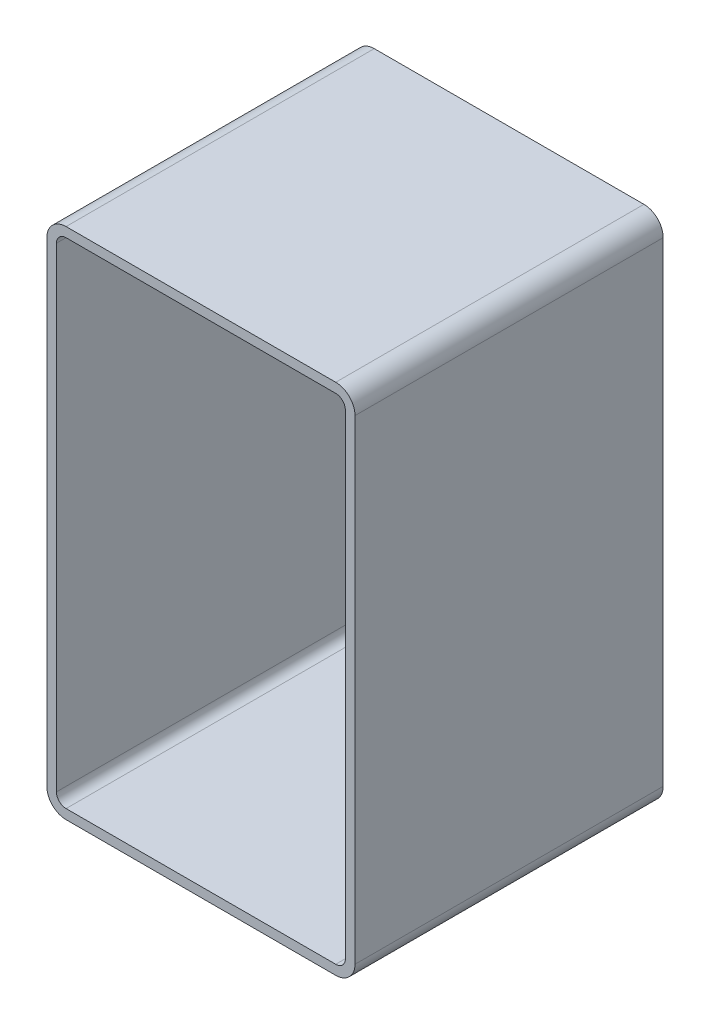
ISO-10303-21;
HEADER;
FILE_DESCRIPTION(('STEP AP214'),'2;1');
FILE_NAME('part.step','',(''),(''),'','','');
FILE_SCHEMA(('AUTOMOTIVE_DESIGN { 1 0 10303 214 1 1 1 1 }'));
ENDSEC;
DATA;
#1=APPLICATION_CONTEXT('core data for automotive mechanical design processes');
#2=APPLICATION_PROTOCOL_DEFINITION('international standard','automotive_design',2000,#1);
#3=PRODUCT_CONTEXT('',#1,'mechanical');
#4=PRODUCT('Part','Part','',(#3));
#5=PRODUCT_RELATED_PRODUCT_CATEGORY('part','',(#4));
#6=PRODUCT_DEFINITION_FORMATION('','',#4);
#7=PRODUCT_DEFINITION_CONTEXT('part definition',#1,'design');
#8=PRODUCT_DEFINITION('design','',#6,#7);
#9=PRODUCT_DEFINITION_SHAPE('','',#8);
#10=(LENGTH_UNIT() NAMED_UNIT(*) SI_UNIT(.MILLI.,.METRE.));
#11=(NAMED_UNIT(*) PLANE_ANGLE_UNIT() SI_UNIT($,.RADIAN.));
#12=(NAMED_UNIT(*) SI_UNIT($,.STERADIAN.) SOLID_ANGLE_UNIT());
#13=UNCERTAINTY_MEASURE_WITH_UNIT(LENGTH_MEASURE(1.E-05),#10,'distance_accuracy_value','');
#14=(GEOMETRIC_REPRESENTATION_CONTEXT(3) GLOBAL_UNCERTAINTY_ASSIGNED_CONTEXT((#13)) GLOBAL_UNIT_ASSIGNED_CONTEXT((#10,
#11,#12)) REPRESENTATION_CONTEXT('',''));
#15=CARTESIAN_POINT('',(0.,0.,0.));
#16=DIRECTION('',(0.,0.,1.));
#17=DIRECTION('',(1.,0.,0.));
#18=AXIS2_PLACEMENT_3D('',#15,#16,#17);
#19=CARTESIAN_POINT('',(20.1567030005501,490.641228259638,304.8));
#20=DIRECTION('',(0.,0.,1.));
#21=DIRECTION('',(1.,0.,0.));
#22=AXIS2_PLACEMENT_3D('',#19,#20,#21);
#23=PLANE('',#22);
#24=CARTESIAN_POINT('',(20.1567030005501,490.641228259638,304.8));
#25=DIRECTION('',(0.,0.,1.));
#26=DIRECTION('',(1.,0.,0.));
#27=AXIS2_PLACEMENT_3D('',#24,#25,#26);
#28=CIRCLE('',#27,19.05);
#29=CARTESIAN_POINT('',(20.1567030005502,509.691228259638,304.8));
#30=VERTEX_POINT('',#29);
#31=CARTESIAN_POINT('',(1.10670300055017,490.641228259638,304.8));
#32=VERTEX_POINT('',#31);
#33=EDGE_CURVE('E211',#30,#32,#28,.T.);
#34=ORIENTED_EDGE('',*,*,#33,.T.);
#35=DIRECTION('',(0.,-1.,0.));
#36=VECTOR('',#35,1.);
#37=CARTESIAN_POINT('',(1.10670300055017,20.741228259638,304.8));
#38=LINE('',#37,#36);
#39=CARTESIAN_POINT('',(1.10670300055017,20.741228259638,304.8));
#40=VERTEX_POINT('',#39);
#41=EDGE_CURVE('E214',#32,#40,#38,.T.);
#42=ORIENTED_EDGE('',*,*,#41,.T.);
#43=CARTESIAN_POINT('',(20.1567030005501,20.741228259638,304.8));
#44=DIRECTION('',(0.,0.,1.));
#45=DIRECTION('',(1.,0.,0.));
#46=AXIS2_PLACEMENT_3D('',#43,#44,#45);
#47=CIRCLE('',#46,19.05);
#48=CARTESIAN_POINT('',(20.1567030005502,1.69122825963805,304.8));
#49=VERTEX_POINT('',#48);
#50=EDGE_CURVE('E217',#40,#49,#47,.T.);
#51=ORIENTED_EDGE('',*,*,#50,.T.);
#52=DIRECTION('',(1.,0.,0.));
#53=VECTOR('',#52,1.);
#54=CARTESIAN_POINT('',(286.85670300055,1.69122825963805,304.8));
#55=LINE('',#54,#53);
#56=CARTESIAN_POINT('',(286.85670300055,1.69122825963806,304.8));
#57=VERTEX_POINT('',#56);
#58=EDGE_CURVE('E219',#49,#57,#55,.T.);
#59=ORIENTED_EDGE('',*,*,#58,.T.);
#60=CARTESIAN_POINT('',(286.85670300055,20.741228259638,304.8));
#61=DIRECTION('',(0.,0.,1.));
#62=DIRECTION('',(1.,0.,0.));
#63=AXIS2_PLACEMENT_3D('',#60,#61,#62);
#64=CIRCLE('',#63,19.05);
#65=CARTESIAN_POINT('',(305.90670300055,20.741228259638,304.8));
#66=VERTEX_POINT('',#65);
#67=EDGE_CURVE('E221',#57,#66,#64,.T.);
#68=ORIENTED_EDGE('',*,*,#67,.T.);
#69=DIRECTION('',(0.,1.,0.));
#70=VECTOR('',#69,1.);
#71=CARTESIAN_POINT('',(305.90670300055,490.641228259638,304.8));
#72=LINE('',#71,#70);
#73=CARTESIAN_POINT('',(305.90670300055,490.641228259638,304.8));
#74=VERTEX_POINT('',#73);
#75=EDGE_CURVE('E223',#66,#74,#72,.T.);
#76=ORIENTED_EDGE('',*,*,#75,.T.);
#77=CARTESIAN_POINT('',(286.85670300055,490.641228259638,304.8));
#78=DIRECTION('',(0.,0.,1.));
#79=DIRECTION('',(1.,0.,0.));
#80=AXIS2_PLACEMENT_3D('',#77,#78,#79);
#81=CIRCLE('',#80,19.05);
#82=CARTESIAN_POINT('',(286.85670300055,509.691228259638,304.8));
#83=VERTEX_POINT('',#82);
#84=EDGE_CURVE('E225',#74,#83,#81,.T.);
#85=ORIENTED_EDGE('',*,*,#84,.T.);
#86=DIRECTION('',(-1.,0.,0.));
#87=VECTOR('',#86,1.);
#88=CARTESIAN_POINT('',(20.1567030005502,509.691228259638,304.8));
#89=LINE('',#88,#87);
#90=EDGE_CURVE('E227',#83,#30,#89,.T.);
#91=ORIENTED_EDGE('',*,*,#90,.T.);
#92=EDGE_LOOP('',(#34,#42,#51,#59,#68,#76,#85,#91));
#93=FACE_BOUND('',#92,.T.);
#94=DIRECTION('',(0.,-1.,0.));
#95=VECTOR('',#94,1.);
#96=CARTESIAN_POINT('',(10.6317030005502,20.741228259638,304.8));
#97=LINE('',#96,#95);
#98=CARTESIAN_POINT('',(10.6317030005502,490.641228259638,304.8));
#99=VERTEX_POINT('',#98);
#100=CARTESIAN_POINT('',(10.6317030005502,20.741228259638,304.8));
#101=VERTEX_POINT('',#100);
#102=EDGE_CURVE('E154',#99,#101,#97,.T.);
#103=ORIENTED_EDGE('',*,*,#102,.F.);
#104=CARTESIAN_POINT('',(20.1567030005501,490.641228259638,304.8));
#105=DIRECTION('',(0.,0.,1.));
#106=DIRECTION('',(1.,0.,0.));
#107=AXIS2_PLACEMENT_3D('',#104,#105,#106);
#108=CIRCLE('',#107,9.52499999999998);
#109=CARTESIAN_POINT('',(20.1567030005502,500.166228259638,304.8));
#110=VERTEX_POINT('',#109);
#111=EDGE_CURVE('E146',#110,#99,#108,.T.);
#112=ORIENTED_EDGE('',*,*,#111,.F.);
#113=DIRECTION('',(-1.,0.,0.));
#114=VECTOR('',#113,1.);
#115=CARTESIAN_POINT('',(20.1567030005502,500.166228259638,304.8));
#116=LINE('',#115,#114);
#117=CARTESIAN_POINT('',(286.85670300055,500.166228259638,304.8));
#118=VERTEX_POINT('',#117);
#119=EDGE_CURVE('E179',#118,#110,#116,.T.);
#120=ORIENTED_EDGE('',*,*,#119,.F.);
#121=CARTESIAN_POINT('',(286.85670300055,490.641228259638,304.8));
#122=DIRECTION('',(0.,0.,1.));
#123=DIRECTION('',(1.,0.,0.));
#124=AXIS2_PLACEMENT_3D('',#121,#122,#123);
#125=CIRCLE('',#124,9.52499999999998);
#126=CARTESIAN_POINT('',(296.38170300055,490.641228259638,304.8));
#127=VERTEX_POINT('',#126);
#128=EDGE_CURVE('E177',#127,#118,#125,.T.);
#129=ORIENTED_EDGE('',*,*,#128,.F.);
#130=DIRECTION('',(0.,1.,0.));
#131=VECTOR('',#130,1.);
#132=CARTESIAN_POINT('',(296.38170300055,490.641228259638,304.8));
#133=LINE('',#132,#131);
#134=CARTESIAN_POINT('',(296.38170300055,20.741228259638,304.8));
#135=VERTEX_POINT('',#134);
#136=EDGE_CURVE('E175',#135,#127,#133,.T.);
#137=ORIENTED_EDGE('',*,*,#136,.F.);
#138=CARTESIAN_POINT('',(286.85670300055,20.741228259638,304.8));
#139=DIRECTION('',(0.,0.,1.));
#140=DIRECTION('',(1.,0.,0.));
#141=AXIS2_PLACEMENT_3D('',#138,#139,#140);
#142=CIRCLE('',#141,9.52499999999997);
#143=CARTESIAN_POINT('',(286.85670300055,11.2162282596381,304.8));
#144=VERTEX_POINT('',#143);
#145=EDGE_CURVE('E173',#144,#135,#142,.T.);
#146=ORIENTED_EDGE('',*,*,#145,.F.);
#147=DIRECTION('',(1.,0.,0.));
#148=VECTOR('',#147,1.);
#149=CARTESIAN_POINT('',(286.85670300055,11.216228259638,304.8));
#150=LINE('',#149,#148);
#151=CARTESIAN_POINT('',(20.1567030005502,11.216228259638,304.8));
#152=VERTEX_POINT('',#151);
#153=EDGE_CURVE('E169',#152,#144,#150,.T.);
#154=ORIENTED_EDGE('',*,*,#153,.F.);
#155=CARTESIAN_POINT('',(20.1567030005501,20.741228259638,304.8));
#156=DIRECTION('',(0.,0.,1.));
#157=DIRECTION('',(1.,0.,0.));
#158=AXIS2_PLACEMENT_3D('',#155,#156,#157);
#159=CIRCLE('',#158,9.52499999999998);
#160=EDGE_CURVE('E167',#101,#152,#159,.T.);
#161=ORIENTED_EDGE('',*,*,#160,.F.);
#162=EDGE_LOOP('',(#103,#112,#120,#129,#137,#146,#154,#161));
#163=FACE_BOUND('',#162,.T.);
#164=ADVANCED_FACE('F33',(#93,#163),#23,.T.);
#165=CARTESIAN_POINT('',(20.1567030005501,490.641228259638,0.));
#166=DIRECTION('',(0.,0.,1.));
#167=DIRECTION('',(1.,0.,0.));
#168=AXIS2_PLACEMENT_3D('',#165,#166,#167);
#169=PLANE('',#168);
#170=CARTESIAN_POINT('',(20.1567030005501,490.641228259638,0.));
#171=DIRECTION('',(0.,0.,1.));
#172=DIRECTION('',(1.,0.,0.));
#173=AXIS2_PLACEMENT_3D('',#170,#171,#172);
#174=CIRCLE('',#173,19.05);
#175=CARTESIAN_POINT('',(20.1567030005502,509.691228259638,0.));
#176=VERTEX_POINT('',#175);
#177=CARTESIAN_POINT('',(1.10670300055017,490.641228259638,0.));
#178=VERTEX_POINT('',#177);
#179=EDGE_CURVE('E162',#176,#178,#174,.T.);
#180=ORIENTED_EDGE('',*,*,#179,.F.);
#181=DIRECTION('',(-1.,0.,0.));
#182=VECTOR('',#181,1.);
#183=CARTESIAN_POINT('',(20.1567030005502,509.691228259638,0.));
#184=LINE('',#183,#182);
#185=CARTESIAN_POINT('',(286.85670300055,509.691228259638,0.));
#186=VERTEX_POINT('',#185);
#187=EDGE_CURVE('E215',#186,#176,#184,.T.);
#188=ORIENTED_EDGE('',*,*,#187,.F.);
#189=CARTESIAN_POINT('',(286.85670300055,490.641228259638,0.));
#190=DIRECTION('',(0.,0.,1.));
#191=DIRECTION('',(1.,0.,0.));
#192=AXIS2_PLACEMENT_3D('',#189,#190,#191);
#193=CIRCLE('',#192,19.05);
#194=CARTESIAN_POINT('',(305.90670300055,490.641228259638,0.));
#195=VERTEX_POINT('',#194);
#196=EDGE_CURVE('E242',#195,#186,#193,.T.);
#197=ORIENTED_EDGE('',*,*,#196,.F.);
#198=DIRECTION('',(0.,1.,0.));
#199=VECTOR('',#198,1.);
#200=CARTESIAN_POINT('',(305.90670300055,490.641228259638,0.));
#201=LINE('',#200,#199);
#202=CARTESIAN_POINT('',(305.90670300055,20.741228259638,0.));
#203=VERTEX_POINT('',#202);
#204=EDGE_CURVE('E240',#203,#195,#201,.T.);
#205=ORIENTED_EDGE('',*,*,#204,.F.);
#206=CARTESIAN_POINT('',(286.85670300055,20.741228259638,0.));
#207=DIRECTION('',(0.,0.,1.));
#208=DIRECTION('',(1.,0.,0.));
#209=AXIS2_PLACEMENT_3D('',#206,#207,#208);
#210=CIRCLE('',#209,19.05);
#211=CARTESIAN_POINT('',(286.85670300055,1.69122825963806,0.));
#212=VERTEX_POINT('',#211);
#213=EDGE_CURVE('E238',#212,#203,#210,.T.);
#214=ORIENTED_EDGE('',*,*,#213,.F.);
#215=DIRECTION('',(1.,0.,0.));
#216=VECTOR('',#215,1.);
#217=CARTESIAN_POINT('',(286.85670300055,1.69122825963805,0.));
#218=LINE('',#217,#216);
#219=CARTESIAN_POINT('',(20.1567030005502,1.69122825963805,0.));
#220=VERTEX_POINT('',#219);
#221=EDGE_CURVE('E236',#220,#212,#218,.T.);
#222=ORIENTED_EDGE('',*,*,#221,.F.);
#223=CARTESIAN_POINT('',(20.1567030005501,20.741228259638,0.));
#224=DIRECTION('',(0.,0.,1.));
#225=DIRECTION('',(1.,0.,0.));
#226=AXIS2_PLACEMENT_3D('',#223,#224,#225);
#227=CIRCLE('',#226,19.05);
#228=CARTESIAN_POINT('',(1.10670300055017,20.741228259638,0.));
#229=VERTEX_POINT('',#228);
#230=EDGE_CURVE('E234',#229,#220,#227,.T.);
#231=ORIENTED_EDGE('',*,*,#230,.F.);
#232=DIRECTION('',(0.,-1.,0.));
#233=VECTOR('',#232,1.);
#234=CARTESIAN_POINT('',(1.10670300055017,20.741228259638,0.));
#235=LINE('',#234,#233);
#236=EDGE_CURVE('E232',#178,#229,#235,.T.);
#237=ORIENTED_EDGE('',*,*,#236,.F.);
#238=EDGE_LOOP('',(#180,#188,#197,#205,#214,#222,#231,#237));
#239=FACE_BOUND('',#238,.T.);
#240=CARTESIAN_POINT('',(20.1567030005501,490.641228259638,0.));
#241=DIRECTION('',(0.,0.,1.));
#242=DIRECTION('',(1.,0.,0.));
#243=AXIS2_PLACEMENT_3D('',#240,#241,#242);
#244=CIRCLE('',#243,9.52499999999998);
#245=CARTESIAN_POINT('',(20.1567030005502,500.166228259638,0.));
#246=VERTEX_POINT('',#245);
#247=CARTESIAN_POINT('',(10.6317030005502,490.641228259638,0.));
#248=VERTEX_POINT('',#247);
#249=EDGE_CURVE('E56',#246,#248,#244,.T.);
#250=ORIENTED_EDGE('',*,*,#249,.T.);
#251=DIRECTION('',(0.,-1.,0.));
#252=VECTOR('',#251,1.);
#253=CARTESIAN_POINT('',(10.6317030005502,20.741228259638,0.));
#254=LINE('',#253,#252);
#255=CARTESIAN_POINT('',(10.6317030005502,20.741228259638,0.));
#256=VERTEX_POINT('',#255);
#257=EDGE_CURVE('E161',#248,#256,#254,.T.);
#258=ORIENTED_EDGE('',*,*,#257,.T.);
#259=CARTESIAN_POINT('',(20.1567030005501,20.741228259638,0.));
#260=DIRECTION('',(0.,0.,1.));
#261=DIRECTION('',(1.,0.,0.));
#262=AXIS2_PLACEMENT_3D('',#259,#260,#261);
#263=CIRCLE('',#262,9.52499999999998);
#264=CARTESIAN_POINT('',(20.1567030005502,11.216228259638,0.));
#265=VERTEX_POINT('',#264);
#266=EDGE_CURVE('E183',#256,#265,#263,.T.);
#267=ORIENTED_EDGE('',*,*,#266,.T.);
#268=DIRECTION('',(1.,0.,0.));
#269=VECTOR('',#268,1.);
#270=CARTESIAN_POINT('',(286.85670300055,11.216228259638,0.));
#271=LINE('',#270,#269);
#272=CARTESIAN_POINT('',(286.85670300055,11.2162282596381,0.));
#273=VERTEX_POINT('',#272);
#274=EDGE_CURVE('E186',#265,#273,#271,.T.);
#275=ORIENTED_EDGE('',*,*,#274,.T.);
#276=CARTESIAN_POINT('',(286.85670300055,20.741228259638,0.));
#277=DIRECTION('',(0.,0.,1.));
#278=DIRECTION('',(1.,0.,0.));
#279=AXIS2_PLACEMENT_3D('',#276,#277,#278);
#280=CIRCLE('',#279,9.52499999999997);
#281=CARTESIAN_POINT('',(296.38170300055,20.741228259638,0.));
#282=VERTEX_POINT('',#281);
#283=EDGE_CURVE('E189',#273,#282,#280,.T.);
#284=ORIENTED_EDGE('',*,*,#283,.T.);
#285=DIRECTION('',(0.,1.,0.));
#286=VECTOR('',#285,1.);
#287=CARTESIAN_POINT('',(296.38170300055,490.641228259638,0.));
#288=LINE('',#287,#286);
#289=CARTESIAN_POINT('',(296.38170300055,490.641228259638,0.));
#290=VERTEX_POINT('',#289);
#291=EDGE_CURVE('E192',#282,#290,#288,.T.);
#292=ORIENTED_EDGE('',*,*,#291,.T.);
#293=CARTESIAN_POINT('',(286.85670300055,490.641228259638,0.));
#294=DIRECTION('',(0.,0.,1.));
#295=DIRECTION('',(1.,0.,0.));
#296=AXIS2_PLACEMENT_3D('',#293,#294,#295);
#297=CIRCLE('',#296,9.52499999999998);
#298=CARTESIAN_POINT('',(286.85670300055,500.166228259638,0.));
#299=VERTEX_POINT('',#298);
#300=EDGE_CURVE('E195',#290,#299,#297,.T.);
#301=ORIENTED_EDGE('',*,*,#300,.T.);
#302=DIRECTION('',(-1.,0.,0.));
#303=VECTOR('',#302,1.);
#304=CARTESIAN_POINT('',(20.1567030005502,500.166228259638,0.));
#305=LINE('',#304,#303);
#306=EDGE_CURVE('E155',#299,#246,#305,.T.);
#307=ORIENTED_EDGE('',*,*,#306,.T.);
#308=EDGE_LOOP('',(#250,#258,#267,#275,#284,#292,#301,#307));
#309=FACE_BOUND('',#308,.T.);
#310=ADVANCED_FACE('F272',(#239,#309),#169,.F.);
#311=CARTESIAN_POINT('',(20.1567030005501,490.641228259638,304.8));
#312=DIRECTION('',(0.,0.,-1.));
#313=DIRECTION('',(-1.,0.,0.));
#314=AXIS2_PLACEMENT_3D('',#311,#312,#313);
#315=CYLINDRICAL_SURFACE('',#314,19.05);
#316=ORIENTED_EDGE('',*,*,#179,.T.);
#317=DIRECTION('',(0.,0.,-1.));
#318=VECTOR('',#317,1.);
#319=CARTESIAN_POINT('',(1.10670300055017,490.641228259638,304.8));
#320=LINE('',#319,#318);
#321=EDGE_CURVE('E11',#32,#178,#320,.T.);
#322=ORIENTED_EDGE('',*,*,#321,.F.);
#323=ORIENTED_EDGE('',*,*,#33,.F.);
#324=DIRECTION('',(0.,0.,-1.));
#325=VECTOR('',#324,1.);
#326=CARTESIAN_POINT('',(20.1567030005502,509.691228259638,304.8));
#327=LINE('',#326,#325);
#328=EDGE_CURVE('E229',#30,#176,#327,.T.);
#329=ORIENTED_EDGE('',*,*,#328,.T.);
#330=EDGE_LOOP('',(#316,#322,#323,#329));
#331=FACE_BOUND('',#330,.T.);
#332=ADVANCED_FACE('F35',(#331),#315,.T.);
#333=CARTESIAN_POINT('',(1.10670300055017,20.741228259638,304.8));
#334=DIRECTION('',(1.,0.,0.));
#335=DIRECTION('',(0.,0.,-1.));
#336=AXIS2_PLACEMENT_3D('',#333,#334,#335);
#337=PLANE('',#336);
#338=ORIENTED_EDGE('',*,*,#236,.T.);
#339=DIRECTION('',(0.,0.,-1.));
#340=VECTOR('',#339,1.);
#341=CARTESIAN_POINT('',(1.10670300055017,20.741228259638,304.8));
#342=LINE('',#341,#340);
#343=EDGE_CURVE('E41',#40,#229,#342,.T.);
#344=ORIENTED_EDGE('',*,*,#343,.F.);
#345=ORIENTED_EDGE('',*,*,#41,.F.);
#346=ORIENTED_EDGE('',*,*,#321,.T.);
#347=EDGE_LOOP('',(#338,#344,#345,#346));
#348=FACE_BOUND('',#347,.T.);
#349=ADVANCED_FACE('F289',(#348),#337,.F.);
#350=CARTESIAN_POINT('',(20.1567030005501,20.741228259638,304.8));
#351=DIRECTION('',(0.,0.,-1.));
#352=DIRECTION('',(-1.,0.,0.));
#353=AXIS2_PLACEMENT_3D('',#350,#351,#352);
#354=CYLINDRICAL_SURFACE('',#353,19.05);
#355=ORIENTED_EDGE('',*,*,#230,.T.);
#356=DIRECTION('',(0.,0.,-1.));
#357=VECTOR('',#356,1.);
#358=CARTESIAN_POINT('',(20.1567030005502,1.69122825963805,304.8));
#359=LINE('',#358,#357);
#360=EDGE_CURVE('E259',#49,#220,#359,.T.);
#361=ORIENTED_EDGE('',*,*,#360,.F.);
#362=ORIENTED_EDGE('',*,*,#50,.F.);
#363=ORIENTED_EDGE('',*,*,#343,.T.);
#364=EDGE_LOOP('',(#355,#361,#362,#363));
#365=FACE_BOUND('',#364,.T.);
#366=ADVANCED_FACE('F266',(#365),#354,.T.);
#367=CARTESIAN_POINT('',(286.85670300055,1.69122825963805,304.8));
#368=DIRECTION('',(0.,1.,0.));
#369=DIRECTION('',(0.,0.,1.));
#370=AXIS2_PLACEMENT_3D('',#367,#368,#369);
#371=PLANE('',#370);
#372=ORIENTED_EDGE('',*,*,#221,.T.);
#373=DIRECTION('',(0.,0.,-1.));
#374=VECTOR('',#373,1.);
#375=CARTESIAN_POINT('',(286.85670300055,1.69122825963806,304.8));
#376=LINE('',#375,#374);
#377=EDGE_CURVE('E256',#57,#212,#376,.T.);
#378=ORIENTED_EDGE('',*,*,#377,.F.);
#379=ORIENTED_EDGE('',*,*,#58,.F.);
#380=ORIENTED_EDGE('',*,*,#360,.T.);
#381=EDGE_LOOP('',(#372,#378,#379,#380));
#382=FACE_BOUND('',#381,.T.);
#383=ADVANCED_FACE('F278',(#382),#371,.F.);
#384=CARTESIAN_POINT('',(286.85670300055,20.741228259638,304.8));
#385=DIRECTION('',(0.,0.,-1.));
#386=DIRECTION('',(-1.,0.,0.));
#387=AXIS2_PLACEMENT_3D('',#384,#385,#386);
#388=CYLINDRICAL_SURFACE('',#387,19.05);
#389=ORIENTED_EDGE('',*,*,#213,.T.);
#390=DIRECTION('',(0.,0.,-1.));
#391=VECTOR('',#390,1.);
#392=CARTESIAN_POINT('',(305.90670300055,20.741228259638,304.8));
#393=LINE('',#392,#391);
#394=EDGE_CURVE('E253',#66,#203,#393,.T.);
#395=ORIENTED_EDGE('',*,*,#394,.F.);
#396=ORIENTED_EDGE('',*,*,#67,.F.);
#397=ORIENTED_EDGE('',*,*,#377,.T.);
#398=EDGE_LOOP('',(#389,#395,#396,#397));
#399=FACE_BOUND('',#398,.T.);
#400=ADVANCED_FACE('F282',(#399),#388,.T.);
#401=CARTESIAN_POINT('',(305.90670300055,490.641228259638,304.8));
#402=DIRECTION('',(-1.,0.,0.));
#403=DIRECTION('',(0.,0.,1.));
#404=AXIS2_PLACEMENT_3D('',#401,#402,#403);
#405=PLANE('',#404);
#406=ORIENTED_EDGE('',*,*,#204,.T.);
#407=DIRECTION('',(0.,0.,-1.));
#408=VECTOR('',#407,1.);
#409=CARTESIAN_POINT('',(305.90670300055,490.641228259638,304.8));
#410=LINE('',#409,#408);
#411=EDGE_CURVE('E250',#74,#195,#410,.T.);
#412=ORIENTED_EDGE('',*,*,#411,.F.);
#413=ORIENTED_EDGE('',*,*,#75,.F.);
#414=ORIENTED_EDGE('',*,*,#394,.T.);
#415=EDGE_LOOP('',(#406,#412,#413,#414));
#416=FACE_BOUND('',#415,.T.);
#417=ADVANCED_FACE('F302',(#416),#405,.F.);
#418=CARTESIAN_POINT('',(286.85670300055,490.641228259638,304.8));
#419=DIRECTION('',(0.,0.,-1.));
#420=DIRECTION('',(-1.,0.,0.));
#421=AXIS2_PLACEMENT_3D('',#418,#419,#420);
#422=CYLINDRICAL_SURFACE('',#421,19.05);
#423=ORIENTED_EDGE('',*,*,#196,.T.);
#424=DIRECTION('',(0.,0.,-1.));
#425=VECTOR('',#424,1.);
#426=CARTESIAN_POINT('',(286.85670300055,509.691228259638,304.8));
#427=LINE('',#426,#425);
#428=EDGE_CURVE('E247',#83,#186,#427,.T.);
#429=ORIENTED_EDGE('',*,*,#428,.F.);
#430=ORIENTED_EDGE('',*,*,#84,.F.);
#431=ORIENTED_EDGE('',*,*,#411,.T.);
#432=EDGE_LOOP('',(#423,#429,#430,#431));
#433=FACE_BOUND('',#432,.T.);
#434=ADVANCED_FACE('F300',(#433),#422,.T.);
#435=CARTESIAN_POINT('',(20.1567030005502,509.691228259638,304.8));
#436=DIRECTION('',(0.,-1.,0.));
#437=DIRECTION('',(0.,0.,-1.));
#438=AXIS2_PLACEMENT_3D('',#435,#436,#437);
#439=PLANE('',#438);
#440=ORIENTED_EDGE('',*,*,#187,.T.);
#441=ORIENTED_EDGE('',*,*,#328,.F.);
#442=ORIENTED_EDGE('',*,*,#90,.F.);
#443=ORIENTED_EDGE('',*,*,#428,.T.);
#444=EDGE_LOOP('',(#440,#441,#442,#443));
#445=FACE_BOUND('',#444,.T.);
#446=ADVANCED_FACE('F295',(#445),#439,.F.);
#447=CARTESIAN_POINT('',(20.1567030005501,490.641228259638,304.8));
#448=DIRECTION('',(0.,0.,-1.));
#449=DIRECTION('',(-1.,0.,0.));
#450=AXIS2_PLACEMENT_3D('',#447,#448,#449);
#451=CYLINDRICAL_SURFACE('',#450,9.52499999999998);
#452=ORIENTED_EDGE('',*,*,#249,.F.);
#453=DIRECTION('',(0.,0.,-1.));
#454=VECTOR('',#453,1.);
#455=CARTESIAN_POINT('',(20.1567030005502,500.166228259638,304.8));
#456=LINE('',#455,#454);
#457=EDGE_CURVE('E150',#110,#246,#456,.T.);
#458=ORIENTED_EDGE('',*,*,#457,.F.);
#459=ORIENTED_EDGE('',*,*,#111,.T.);
#460=DIRECTION('',(0.,0.,-1.));
#461=VECTOR('',#460,1.);
#462=CARTESIAN_POINT('',(10.6317030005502,490.641228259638,304.8));
#463=LINE('',#462,#461);
#464=EDGE_CURVE('E149',#99,#248,#463,.T.);
#465=ORIENTED_EDGE('',*,*,#464,.T.);
#466=EDGE_LOOP('',(#452,#458,#459,#465));
#467=FACE_BOUND('',#466,.T.);
#468=ADVANCED_FACE('F148',(#467),#451,.F.);
#469=CARTESIAN_POINT('',(10.6317030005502,20.741228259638,304.8));
#470=DIRECTION('',(1.,0.,0.));
#471=DIRECTION('',(0.,0.,-1.));
#472=AXIS2_PLACEMENT_3D('',#469,#470,#471);
#473=PLANE('',#472);
#474=ORIENTED_EDGE('',*,*,#257,.F.);
#475=ORIENTED_EDGE('',*,*,#464,.F.);
#476=ORIENTED_EDGE('',*,*,#102,.T.);
#477=DIRECTION('',(0.,0.,-1.));
#478=VECTOR('',#477,1.);
#479=CARTESIAN_POINT('',(10.6317030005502,20.741228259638,304.8));
#480=LINE('',#479,#478);
#481=EDGE_CURVE('E163',#101,#256,#480,.T.);
#482=ORIENTED_EDGE('',*,*,#481,.T.);
#483=EDGE_LOOP('',(#474,#475,#476,#482));
#484=FACE_BOUND('',#483,.T.);
#485=ADVANCED_FACE('F158',(#484),#473,.T.);
#486=CARTESIAN_POINT('',(20.1567030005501,20.741228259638,304.8));
#487=DIRECTION('',(0.,0.,-1.));
#488=DIRECTION('',(-1.,0.,0.));
#489=AXIS2_PLACEMENT_3D('',#486,#487,#488);
#490=CYLINDRICAL_SURFACE('',#489,9.52499999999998);
#491=ORIENTED_EDGE('',*,*,#266,.F.);
#492=ORIENTED_EDGE('',*,*,#481,.F.);
#493=ORIENTED_EDGE('',*,*,#160,.T.);
#494=DIRECTION('',(0.,0.,-1.));
#495=VECTOR('',#494,1.);
#496=CARTESIAN_POINT('',(20.1567030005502,11.216228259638,304.8));
#497=LINE('',#496,#495);
#498=EDGE_CURVE('E208',#152,#265,#497,.T.);
#499=ORIENTED_EDGE('',*,*,#498,.T.);
#500=EDGE_LOOP('',(#491,#492,#493,#499));
#501=FACE_BOUND('',#500,.T.);
#502=ADVANCED_FACE('F327',(#501),#490,.F.);
#503=CARTESIAN_POINT('',(286.85670300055,11.216228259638,304.8));
#504=DIRECTION('',(0.,1.,0.));
#505=DIRECTION('',(0.,0.,1.));
#506=AXIS2_PLACEMENT_3D('',#503,#504,#505);
#507=PLANE('',#506);
#508=ORIENTED_EDGE('',*,*,#274,.F.);
#509=ORIENTED_EDGE('',*,*,#498,.F.);
#510=ORIENTED_EDGE('',*,*,#153,.T.);
#511=DIRECTION('',(0.,0.,-1.));
#512=VECTOR('',#511,1.);
#513=CARTESIAN_POINT('',(286.85670300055,11.2162282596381,304.8));
#514=LINE('',#513,#512);
#515=EDGE_CURVE('E206',#144,#273,#514,.T.);
#516=ORIENTED_EDGE('',*,*,#515,.T.);
#517=EDGE_LOOP('',(#508,#509,#510,#516));
#518=FACE_BOUND('',#517,.T.);
#519=ADVANCED_FACE('F331',(#518),#507,.T.);
#520=CARTESIAN_POINT('',(286.85670300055,20.741228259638,304.8));
#521=DIRECTION('',(0.,0.,-1.));
#522=DIRECTION('',(-1.,0.,0.));
#523=AXIS2_PLACEMENT_3D('',#520,#521,#522);
#524=CYLINDRICAL_SURFACE('',#523,9.52499999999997);
#525=ORIENTED_EDGE('',*,*,#283,.F.);
#526=ORIENTED_EDGE('',*,*,#515,.F.);
#527=ORIENTED_EDGE('',*,*,#145,.T.);
#528=DIRECTION('',(0.,0.,-1.));
#529=VECTOR('',#528,1.);
#530=CARTESIAN_POINT('',(296.38170300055,20.741228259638,304.8));
#531=LINE('',#530,#529);
#532=EDGE_CURVE('E204',#135,#282,#531,.T.);
#533=ORIENTED_EDGE('',*,*,#532,.T.);
#534=EDGE_LOOP('',(#525,#526,#527,#533));
#535=FACE_BOUND('',#534,.T.);
#536=ADVANCED_FACE('F337',(#535),#524,.F.);
#537=CARTESIAN_POINT('',(296.38170300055,490.641228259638,304.8));
#538=DIRECTION('',(-1.,0.,0.));
#539=DIRECTION('',(0.,0.,1.));
#540=AXIS2_PLACEMENT_3D('',#537,#538,#539);
#541=PLANE('',#540);
#542=ORIENTED_EDGE('',*,*,#291,.F.);
#543=ORIENTED_EDGE('',*,*,#532,.F.);
#544=ORIENTED_EDGE('',*,*,#136,.T.);
#545=DIRECTION('',(0.,0.,-1.));
#546=VECTOR('',#545,1.);
#547=CARTESIAN_POINT('',(296.38170300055,490.641228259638,304.8));
#548=LINE('',#547,#546);
#549=EDGE_CURVE('E202',#127,#290,#548,.T.);
#550=ORIENTED_EDGE('',*,*,#549,.T.);
#551=EDGE_LOOP('',(#542,#543,#544,#550));
#552=FACE_BOUND('',#551,.T.);
#553=ADVANCED_FACE('F341',(#552),#541,.T.);
#554=CARTESIAN_POINT('',(286.85670300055,490.641228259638,304.8));
#555=DIRECTION('',(0.,0.,-1.));
#556=DIRECTION('',(-1.,0.,0.));
#557=AXIS2_PLACEMENT_3D('',#554,#555,#556);
#558=CYLINDRICAL_SURFACE('',#557,9.52499999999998);
#559=ORIENTED_EDGE('',*,*,#300,.F.);
#560=ORIENTED_EDGE('',*,*,#549,.F.);
#561=ORIENTED_EDGE('',*,*,#128,.T.);
#562=DIRECTION('',(0.,0.,-1.));
#563=VECTOR('',#562,1.);
#564=CARTESIAN_POINT('',(286.85670300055,500.166228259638,304.8));
#565=LINE('',#564,#563);
#566=EDGE_CURVE('E48',#118,#299,#565,.T.);
#567=ORIENTED_EDGE('',*,*,#566,.T.);
#568=EDGE_LOOP('',(#559,#560,#561,#567));
#569=FACE_BOUND('',#568,.T.);
#570=ADVANCED_FACE('F345',(#569),#558,.F.);
#571=CARTESIAN_POINT('',(20.1567030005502,500.166228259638,304.8));
#572=DIRECTION('',(0.,-1.,0.));
#573=DIRECTION('',(0.,0.,-1.));
#574=AXIS2_PLACEMENT_3D('',#571,#572,#573);
#575=PLANE('',#574);
#576=ORIENTED_EDGE('',*,*,#306,.F.);
#577=ORIENTED_EDGE('',*,*,#566,.F.);
#578=ORIENTED_EDGE('',*,*,#119,.T.);
#579=ORIENTED_EDGE('',*,*,#457,.T.);
#580=EDGE_LOOP('',(#576,#577,#578,#579));
#581=FACE_BOUND('',#580,.T.);
#582=ADVANCED_FACE('F349',(#581),#575,.T.);
#583=CLOSED_SHELL('',(#164,#310,#332,#349,#366,#383,#400,#417,#434,#446,#468,#485,#502,#519,
#536,#553,#570,#582));
#584=MANIFOLD_SOLID_BREP('B2',#583);
#585=ADVANCED_BREP_SHAPE_REPRESENTATION('',(#18,#584),#14);
#586=SHAPE_DEFINITION_REPRESENTATION(#9,#585);
ENDSEC;
END-ISO-10303-21;
